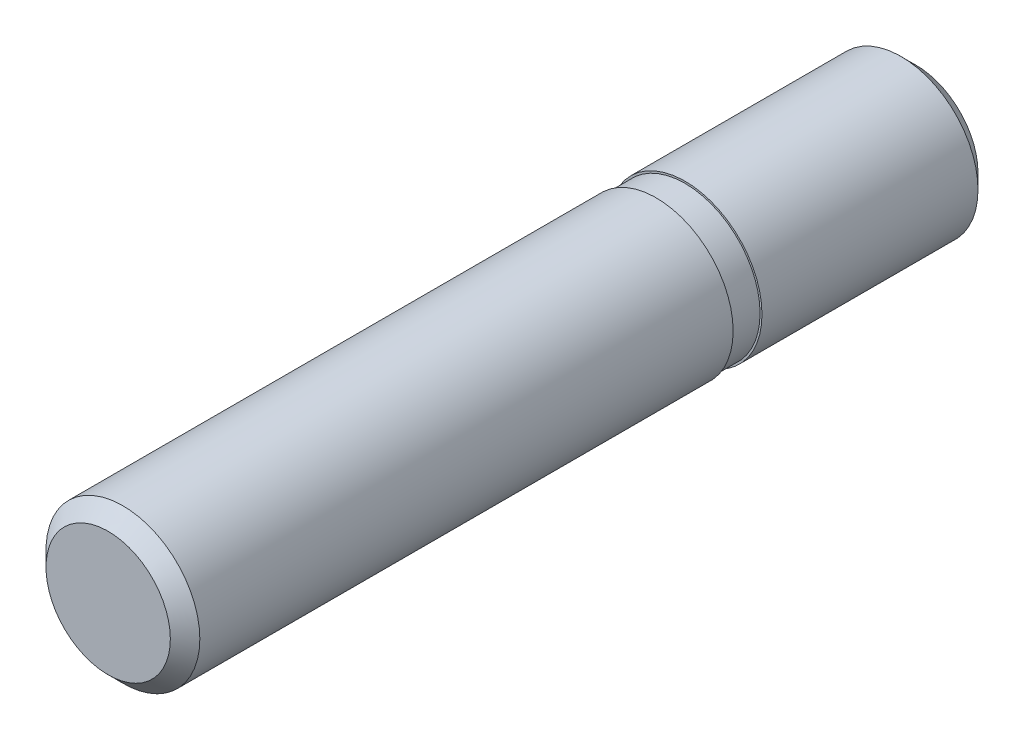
ISO-10303-21;
HEADER;
FILE_DESCRIPTION(('STEP AP214'),'2;1');
FILE_NAME('part.step','',(''),(''),'','','');
FILE_SCHEMA(('AUTOMOTIVE_DESIGN { 1 0 10303 214 1 1 1 1 }'));
ENDSEC;
DATA;
#1=APPLICATION_CONTEXT('core data for automotive mechanical design processes');
#2=APPLICATION_PROTOCOL_DEFINITION('international standard','automotive_design',2000,#1);
#3=PRODUCT_CONTEXT('',#1,'mechanical');
#4=PRODUCT('Part','Part','',(#3));
#5=PRODUCT_RELATED_PRODUCT_CATEGORY('part','',(#4));
#6=PRODUCT_DEFINITION_FORMATION('','',#4);
#7=PRODUCT_DEFINITION_CONTEXT('part definition',#1,'design');
#8=PRODUCT_DEFINITION('design','',#6,#7);
#9=PRODUCT_DEFINITION_SHAPE('','',#8);
#10=(LENGTH_UNIT() NAMED_UNIT(*) SI_UNIT(.MILLI.,.METRE.));
#11=(NAMED_UNIT(*) PLANE_ANGLE_UNIT() SI_UNIT($,.RADIAN.));
#12=(NAMED_UNIT(*) SI_UNIT($,.STERADIAN.) SOLID_ANGLE_UNIT());
#13=UNCERTAINTY_MEASURE_WITH_UNIT(LENGTH_MEASURE(1.E-05),#10,'distance_accuracy_value','');
#14=(GEOMETRIC_REPRESENTATION_CONTEXT(3) GLOBAL_UNCERTAINTY_ASSIGNED_CONTEXT((#13)) GLOBAL_UNIT_ASSIGNED_CONTEXT((#10,
#11,#12)) REPRESENTATION_CONTEXT('',''));
#15=CARTESIAN_POINT('',(0.,0.,0.));
#16=DIRECTION('',(0.,0.,1.));
#17=DIRECTION('',(1.,0.,0.));
#18=AXIS2_PLACEMENT_3D('',#15,#16,#17);
#19=CARTESIAN_POINT('',(0.,1.6165,-12.));
#20=DIRECTION('',(0.,0.,-1.));
#21=DIRECTION('',(-1.,0.,0.));
#22=AXIS2_PLACEMENT_3D('',#19,#20,#21);
#23=PLANE('',#22);
#24=CARTESIAN_POINT('',(0.,0.,-12.0000000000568));
#25=DIRECTION('',(0.,0.,1.));
#26=DIRECTION('',(1.,0.,0.));
#27=AXIS2_PLACEMENT_3D('',#24,#25,#26);
#28=CIRCLE('',#27,3.23300000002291);
#29=CARTESIAN_POINT('',(3.23300000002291,0.,-12.0000000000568));
#30=VERTEX_POINT('',#29);
#31=EDGE_CURVE('E19',#30,#30,#28,.T.);
#32=ORIENTED_EDGE('',*,*,#31,.F.);
#33=EDGE_LOOP('',(#32));
#34=FACE_BOUND('',#33,.T.);
#35=ADVANCED_FACE('F12',(#34),#23,.T.);
#36=CARTESIAN_POINT('',(0.,0.,-11.2330000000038));
#37=DIRECTION('',(0.,0.,1.));
#38=DIRECTION('',(1.,0.,0.));
#39=AXIS2_PLACEMENT_3D('',#36,#37,#38);
#40=CONICAL_SURFACE('',#39,4.00000000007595,0.785398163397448);
#41=CARTESIAN_POINT('',(0.,0.,-11.233));
#42=DIRECTION('',(0.,0.,1.));
#43=DIRECTION('',(1.,0.,0.));
#44=AXIS2_PLACEMENT_3D('',#41,#42,#43);
#45=CIRCLE('',#44,4.);
#46=CARTESIAN_POINT('',(4.,0.,-11.233));
#47=VERTEX_POINT('',#46);
#48=EDGE_CURVE('E23',#47,#47,#45,.T.);
#49=ORIENTED_EDGE('',*,*,#48,.F.);
#50=EDGE_LOOP('',(#49));
#51=FACE_BOUND('',#50,.T.);
#52=ORIENTED_EDGE('',*,*,#31,.T.);
#53=EDGE_LOOP('',(#52));
#54=FACE_BOUND('',#53,.T.);
#55=ADVANCED_FACE('F66',(#51,#54),#40,.T.);
#56=CARTESIAN_POINT('',(0.,0.,4.75));
#57=DIRECTION('',(0.,0.,1.));
#58=DIRECTION('',(1.,0.,0.));
#59=AXIS2_PLACEMENT_3D('',#56,#57,#58);
#60=CYLINDRICAL_SURFACE('',#59,4.);
#61=CARTESIAN_POINT('',(0.,0.,0.));
#62=DIRECTION('',(0.,0.,1.));
#63=DIRECTION('',(1.,0.,0.));
#64=AXIS2_PLACEMENT_3D('',#61,#62,#63);
#65=CIRCLE('',#64,4.);
#66=CARTESIAN_POINT('',(4.,0.,0.));
#67=VERTEX_POINT('',#66);
#68=EDGE_CURVE('E28',#67,#67,#65,.T.);
#69=ORIENTED_EDGE('',*,*,#68,.F.);
#70=EDGE_LOOP('',(#69));
#71=FACE_BOUND('',#70,.T.);
#72=ORIENTED_EDGE('',*,*,#48,.T.);
#73=EDGE_LOOP('',(#72));
#74=FACE_BOUND('',#73,.T.);
#75=ADVANCED_FACE('F72',(#71,#74),#60,.T.);
#76=CARTESIAN_POINT('',(0.,0.,0.));
#77=DIRECTION('',(0.,0.,1.));
#78=DIRECTION('',(1.,0.,0.));
#79=AXIS2_PLACEMENT_3D('',#76,#77,#78);
#80=PLANE('',#79);
#81=CARTESIAN_POINT('',(0.,0.,0.));
#82=DIRECTION('',(0.,0.,1.));
#83=DIRECTION('',(1.,0.,0.));
#84=AXIS2_PLACEMENT_3D('',#81,#82,#83);
#85=CIRCLE('',#84,3.9);
#86=CARTESIAN_POINT('',(3.9,0.,0.));
#87=VERTEX_POINT('',#86);
#88=EDGE_CURVE('E8',#87,#87,#85,.T.);
#89=ORIENTED_EDGE('',*,*,#88,.F.);
#90=EDGE_LOOP('',(#89));
#91=FACE_BOUND('',#90,.T.);
#92=ORIENTED_EDGE('',*,*,#68,.T.);
#93=EDGE_LOOP('',(#92));
#94=FACE_BOUND('',#93,.T.);
#95=ADVANCED_FACE('F77',(#91,#94),#80,.T.);
#96=CARTESIAN_POINT('',(0.,0.,-2.59665295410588));
#97=DIRECTION('',(0.,0.,-1.));
#98=DIRECTION('',(-1.,0.,0.));
#99=AXIS2_PLACEMENT_3D('',#96,#97,#98);
#100=CYLINDRICAL_SURFACE('',#99,3.9);
#101=CARTESIAN_POINT('',(0.,0.,1.5));
#102=DIRECTION('',(0.,0.,-1.));
#103=DIRECTION('',(-1.,0.,0.));
#104=AXIS2_PLACEMENT_3D('',#101,#102,#103);
#105=CIRCLE('',#104,3.9);
#106=CARTESIAN_POINT('',(-3.9,0.,1.5));
#107=VERTEX_POINT('',#106);
#108=EDGE_CURVE('E44',#107,#107,#105,.T.);
#109=ORIENTED_EDGE('',*,*,#108,.T.);
#110=EDGE_LOOP('',(#109));
#111=FACE_BOUND('',#110,.T.);
#112=ORIENTED_EDGE('',*,*,#88,.T.);
#113=EDGE_LOOP('',(#112));
#114=FACE_BOUND('',#113,.T.);
#115=ADVANCED_FACE('F51',(#111,#114),#100,.T.);
#116=CARTESIAN_POINT('',(0.,0.,30.));
#117=DIRECTION('',(0.,0.,1.));
#118=DIRECTION('',(1.,0.,0.));
#119=AXIS2_PLACEMENT_3D('',#116,#117,#118);
#120=PLANE('',#119);
#121=CARTESIAN_POINT('',(0.,0.,30.));
#122=DIRECTION('',(0.,0.,1.));
#123=DIRECTION('',(1.,0.,0.));
#124=AXIS2_PLACEMENT_3D('',#121,#122,#123);
#125=CIRCLE('',#124,3.233);
#126=CARTESIAN_POINT('',(3.233,0.,30.));
#127=VERTEX_POINT('',#126);
#128=EDGE_CURVE('E40',#127,#127,#125,.T.);
#129=ORIENTED_EDGE('',*,*,#128,.T.);
#130=EDGE_LOOP('',(#129));
#131=FACE_BOUND('',#130,.T.);
#132=ADVANCED_FACE('F85',(#131),#120,.T.);
#133=CARTESIAN_POINT('',(0.,0.,30.));
#134=DIRECTION('',(0.,0.,-1.));
#135=DIRECTION('',(-1.,0.,0.));
#136=AXIS2_PLACEMENT_3D('',#133,#134,#135);
#137=CONICAL_SURFACE('',#136,3.233,0.785398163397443);
#138=CARTESIAN_POINT('',(0.,0.,29.233));
#139=DIRECTION('',(0.,0.,1.));
#140=DIRECTION('',(1.,0.,0.));
#141=AXIS2_PLACEMENT_3D('',#138,#139,#140);
#142=CIRCLE('',#141,4.);
#143=CARTESIAN_POINT('',(4.,0.,29.233));
#144=VERTEX_POINT('',#143);
#145=EDGE_CURVE('E31',#144,#144,#142,.F.);
#146=ORIENTED_EDGE('',*,*,#145,.F.);
#147=EDGE_LOOP('',(#146));
#148=FACE_BOUND('',#147,.T.);
#149=ORIENTED_EDGE('',*,*,#128,.F.);
#150=EDGE_LOOP('',(#149));
#151=FACE_BOUND('',#150,.T.);
#152=ADVANCED_FACE('F62',(#148,#151),#137,.T.);
#153=CARTESIAN_POINT('',(0.,0.,4.75));
#154=DIRECTION('',(0.,0.,1.));
#155=DIRECTION('',(1.,0.,0.));
#156=AXIS2_PLACEMENT_3D('',#153,#154,#155);
#157=CYLINDRICAL_SURFACE('',#156,4.);
#158=CARTESIAN_POINT('',(0.,0.,1.5));
#159=DIRECTION('',(0.,0.,1.));
#160=DIRECTION('',(1.,0.,0.));
#161=AXIS2_PLACEMENT_3D('',#158,#159,#160);
#162=CIRCLE('',#161,4.);
#163=CARTESIAN_POINT('',(4.,0.,1.5));
#164=VERTEX_POINT('',#163);
#165=EDGE_CURVE('E35',#164,#164,#162,.T.);
#166=ORIENTED_EDGE('',*,*,#165,.T.);
#167=EDGE_LOOP('',(#166));
#168=FACE_BOUND('',#167,.T.);
#169=ORIENTED_EDGE('',*,*,#145,.T.);
#170=EDGE_LOOP('',(#169));
#171=FACE_BOUND('',#170,.T.);
#172=ADVANCED_FACE('F14',(#168,#171),#157,.T.);
#173=CARTESIAN_POINT('',(0.,0.,1.5));
#174=DIRECTION('',(0.,0.,1.));
#175=DIRECTION('',(1.,0.,0.));
#176=AXIS2_PLACEMENT_3D('',#173,#174,#175);
#177=PLANE('',#176);
#178=ORIENTED_EDGE('',*,*,#108,.F.);
#179=EDGE_LOOP('',(#178));
#180=FACE_BOUND('',#179,.T.);
#181=ORIENTED_EDGE('',*,*,#165,.F.);
#182=EDGE_LOOP('',(#181));
#183=FACE_BOUND('',#182,.T.);
#184=ADVANCED_FACE('F53',(#180,#183),#177,.F.);
#185=CLOSED_SHELL('',(#35,#55,#75,#95,#115,#132,#152,#172,#184));
#186=MANIFOLD_SOLID_BREP('B1',#185);
#187=ADVANCED_BREP_SHAPE_REPRESENTATION('',(#18,#186),#14);
#188=SHAPE_DEFINITION_REPRESENTATION(#9,#187);
ENDSEC;
END-ISO-10303-21;
